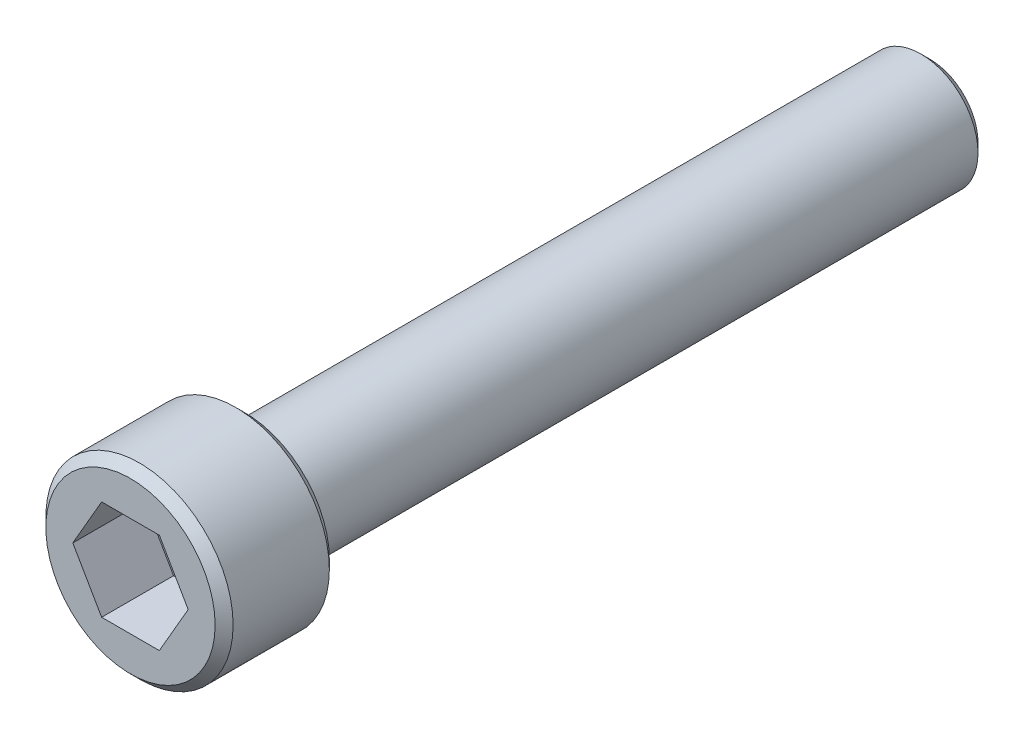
from build123d import *

# Parameters (mm, degrees)
SKETCH1_R           = 1.5875
BOSS_EXTRUDE1_DEPTH = 19.05
SKETCH2_R           = 2.6035
BOSS_EXTRUDE2_DEPTH = 3.175
CUT_EXTRUDE1_DEPTH  = 2
CHAMFER1_SIZE       = 0.25


with BuildPart() as part:
    # Sketch1 → Boss-Extrude1 (new body)
    with BuildSketch(Plane(origin=(0, 0, 0), x_dir=(0, 1, 0), z_dir=(0, 0, 1))):
        with Locations(Location((0, 0, 0), (0, 0, 90))):
            Circle(SKETCH1_R)
    extrude(amount=BOSS_EXTRUDE1_DEPTH)

    # Sketch2 → Boss-Extrude2 (add)
    with BuildSketch(Plane.XY.offset(19.05)):
        Circle(SKETCH2_R)
    extrude(amount=BOSS_EXTRUDE2_DEPTH)

    # Sketch3 → Cut-Extrude1 (cut)
    with BuildSketch(Plane.XY.offset(22.225)):
        Polygon((1.603951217, 0), (0.801975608, 1.3890625), (-0.801975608, 1.3890625), (-1.603951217, 0), (-0.801975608, -1.3890625), (0.801975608, -1.3890625), align=None)
    extrude(amount=-CUT_EXTRUDE1_DEPTH, mode=Mode.SUBTRACT)

    # Chamfer1
    chamfer1_edges = [part.edges().sort_by_distance(p)[0] for p in [
        (1.5875, 0, 0),
        (-2.6035, 0, 19.05),
        (-2.6035, 0, 22.225),
    ]]
    chamfer(chamfer1_edges, length=CHAMFER1_SIZE)


solid = part.part
